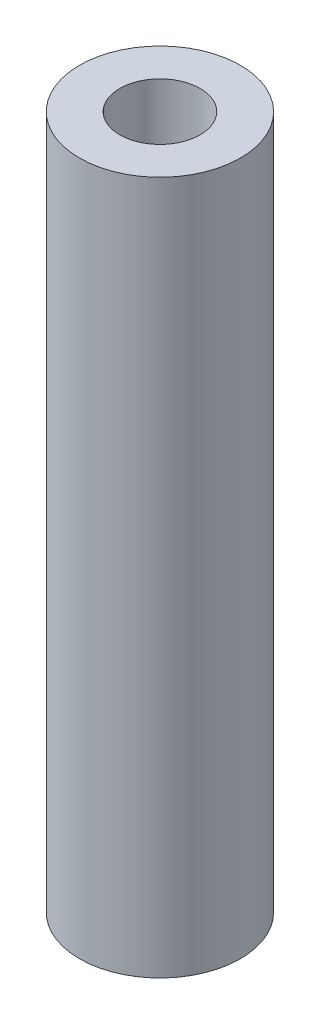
from build123d import *

# Parameters (mm, degrees)
SKETCH1_R           = 8.128
BOSS_EXTRUDE1_DEPTH = 70.104
SKETCH2_R           = 4.064
CUT_EXTRUDE1_DEPTH  = 72.040126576


with BuildPart() as part:
    # Sketch1 → Boss-Extrude1 (new body)
    with BuildSketch(Plane(origin=(0, 0, 0), x_dir=(1, 0, 0), z_dir=(0, 1, 0))):
        with Locations(Location((0, 0, 0), (0, 0, 270))):
            Circle(SKETCH1_R)
    extrude(amount=BOSS_EXTRUDE1_DEPTH)

    # Sketch2 → Cut-Extrude1 (cut, through all)
    with BuildSketch(Plane(origin=(0, 70.104, 0), x_dir=(1, 0, 0), z_dir=(0, 1, 0))):
        with Locations(Location((0, 0, 0), (0, 0, 270))):
            Circle(SKETCH2_R)
    extrude(amount=-CUT_EXTRUDE1_DEPTH, mode=Mode.SUBTRACT)


solid = part.part
